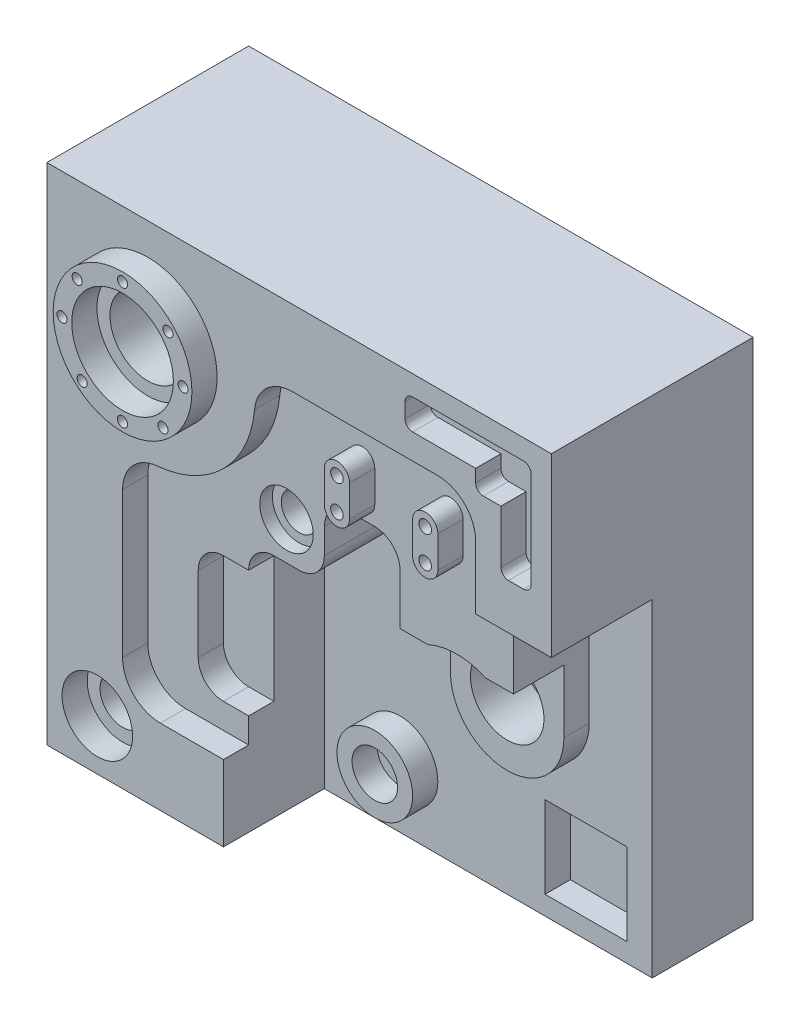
from build123d import *

# Parameters (mm, degrees)
SKETCH1_W                = 200
SKETCH1_H                = 200
BASE_EXTRUDE_DEPTH       = 80
CUT_EXTRUDE1_DEPTH       = 10
SKETCH3_R                = 27.5
BOSS_EXTRUDE4_DEPTH      = 20
CUT_EXTRUDE3_DEPTH       = 30
CUT_EXTRUDE3_DEPTH_BACK  = 30
SKETCH5_W                = 30
SKETCH5_H                = 60
CUT_EXTRUDE6_DEPTH       = 10
SKETCH6_R                = 22.5
CUT_EXTRUDE9_DEPTH       = 40
BOSS_EXTRUDE8_START      = -40
BOSS_EXTRUDE8_DEPTH      = 40
CUT_EXTRUDE10_START      = -30
CUT_EXTRUDE10_DEPTH      = 30
SKETCH9_R                = 27.5
CUT_EXTRUDE14_DEPTH      = 30
CUT_EXTRUDE17_DEPTH      = 10
SKETCH13_R               = 10.606601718
CUT_EXTRUDE20_DEPTH      = 5
SKETCH14_R               = 7.071067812
CUT_EXTRUDE21_DEPTH      = 30
SKETCH16_R               = 14.577379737
CUT_EXTRUDE23_DEPTH      = 20
SKETCH17_R               = 20.155644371
CUT_EXTRUDE24_DEPTH      = 10
SKETCH18_R               = 15
CUT_EXTRUDE25_DEPTH      = 60
SKETCH19_R               = 15
BOSS_EXTRUDE9_DEPTH      = 10
SKETCH20_R               = 9.013878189
CUT_EXTRUDE26_DEPTH      = 10
SKETCH21_R               = 5
CUT_EXTRUDE27_DEPTH      = 30
SKETCH23_W               = 32.5
SKETCH23_H               = 32.5
CUT_EXTRUDE29_DEPTH      = 10
BOSS_EXTRUDE11_DEPTH     = 10
SKETCH26_R               = 2.5
CUT_EXTRUDE30_DEPTH      = 30
CUT_EXTRUDE34_DEPTH      = 10
CUT_EXTRUDE34_DEPTH_BACK = 10
SKETCH27_R               = 2
SKETCH28_R               = 14
CUT_EXTRUDE35_DEPTH      = 10
SKETCH29_R               = 8.94427191
CUT_EXTRUDE36_DEPTH      = 10
SKETCH30_W               = 22
SKETCH30_H               = 20
CUT_EXTRUDE37_DEPTH      = 10
SKETCH31_W               = 12
SKETCH31_H               = 28
CUT_EXTRUDE38_DEPTH      = 10
SKETCH32_W               = 38
SKETCH32_H               = 12
CUT_EXTRUDE39_DEPTH      = 10
FILLET1_R                = 3


with BuildPart() as part:
    # Sketch1 → Base-Extrude (new body)
    with BuildSketch(Plane.XY):
        Rectangle(SKETCH1_W, SKETCH1_H)
    extrude(amount=-BASE_EXTRUDE_DEPTH)

    # Sketch2 → Cut-Extrude1 (cut)
    with BuildSketch(Plane.XY):
        with BuildLine():
            Line((-55, -70), (70, -70))
            Line((70, -70), (70, 55))
            ThreePointArc((70, 55), (65.606601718, 65.606601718), (55, 70))
            Line((55, 70), (-2.717803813, 70))
            ThreePointArc((-2.717803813, 70), (-12.852762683, 66.058146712), (-17.660985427, 56.304347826))
            ThreePointArc((-17.660985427, 56.304347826), (-29.9479618, 29.9479618), (-56.304347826, 17.660985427))
            ThreePointArc((-56.304347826, 17.660985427), (-66.058146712, 12.852762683), (-70, 2.717803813))
            Line((-70, 2.717803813), (-70, -55))
            ThreePointArc((-70, -55), (-65.606601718, -65.606601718), (-55, -70))
        make_face()
    extrude(amount=-CUT_EXTRUDE1_DEPTH, mode=Mode.SUBTRACT)

    # Sketch3 → Boss-Extrude4 (add)
    with BuildSketch(Plane.XY.offset(-10)):
        with Locations(Location((-60, 60, 0), (0, 0, 180))):
            Circle(SKETCH3_R)
    extrude(amount=BOSS_EXTRUDE4_DEPTH)

    # Sketch4 → Cut-Extrude3 (cut, two sides: drawn at the far end of the back side and taken through both)
    with BuildSketch(Plane.XY.offset(-10).offset(-CUT_EXTRUDE3_DEPTH_BACK)):
        with BuildLine():
            Line((-30, -100), (-30, -10))
            ThreePointArc((-30, -10), (-27.071067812, -2.928932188), (-20, 0))
            Line((-20, 0), (-10, 0))
            ThreePointArc((-10, 0), (-2.928932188, 2.928932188), (0, 10))
            Line((0, 10), (0, 20))
            ThreePointArc((0, 20), (2.928932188, 27.071067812), (10, 30))
            Line((10, 30), (20, 30))
            ThreePointArc((20, 30), (27.071067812, 27.071067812), (30, 20))
            Line((30, 20), (30, -10))
            Line((30, -10), (75, -10))
            Line((75, -10), (75, 20))
            ThreePointArc((75, 20), (77.928932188, 27.071067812), (85, 30))
            Line((85, 30), (100, 30))
            Line((100, 30), (100, -100))
            Line((100, -100), (-30, -100))
        make_face()
    extrude(amount=CUT_EXTRUDE3_DEPTH + CUT_EXTRUDE3_DEPTH_BACK, mode=Mode.SUBTRACT)

    # Sketch5 → Cut-Extrude6 (cut)
    with BuildSketch(Plane.XY):
        with Locations((85, 0)):
            Rectangle(SKETCH5_W, SKETCH5_H)
    extrude(amount=-CUT_EXTRUDE6_DEPTH, mode=Mode.SUBTRACT)

    # Sketch6 → Cut-Extrude9 (cut)
    with BuildSketch(Plane.XY.offset(-40)):
        with Locations((52.5, -25)):
            Circle(SKETCH6_R)
    extrude(amount=CUT_EXTRUDE9_DEPTH, mode=Mode.SUBTRACT)

    # Sketch7 → Boss-Extrude8 (add)
    with BuildSketch(Plane.XY.offset(BOSS_EXTRUDE8_START)):
        with BuildLine():
            Line((75, -25), (75, 0))
            Line((75, 0), (30, 0))
            Line((30, 0), (30, -25))
            ThreePointArc((30, -25), (52.5, -47.5), (75, -25))
        make_face()
    extrude(amount=BOSS_EXTRUDE8_DEPTH)

    # Sketch8 → Cut-Extrude10 (cut)
    with BuildSketch(Plane.XY.offset(CUT_EXTRUDE10_START)):
        with BuildLine():
            Line((75, -25), (75, 0))
            Line((75, 0), (30, 0))
            Line((30, 0), (30, -25))
            ThreePointArc((30, -25), (52.5, -47.5), (75, -25))
        make_face()
    extrude(amount=CUT_EXTRUDE10_DEPTH, mode=Mode.SUBTRACT)

    # Sketch9 → Cut-Extrude14 (cut)
    with BuildSketch(Plane.XY):
        with Locations((52.5, -25)):
            Circle(SKETCH9_R)
    extrude(amount=-CUT_EXTRUDE14_DEPTH, mode=Mode.SUBTRACT)

    # Sketch11 → Cut-Extrude17 (cut)
    with BuildSketch(Plane.XY.offset(-10)):
        with BuildLine():
            Line((-40, -10), (-30, -10))
            Line((-30, -10), (-30, -60))
            Line((-30, -60), (-40, -60))
            ThreePointArc((-40, -60), (-47.071067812, -57.071067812), (-50, -50))
            Line((-50, -50), (-50, -20))
            ThreePointArc((-50, -20), (-47.071067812, -12.928932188), (-40, -10))
        make_face()
    extrude(amount=-CUT_EXTRUDE17_DEPTH, mode=Mode.SUBTRACT)

    # Sketch13 → Cut-Extrude20 (cut)
    with BuildSketch(Plane.XY.offset(-10)):
        with Locations((-15, 15)):
            Circle(SKETCH13_R)
    extrude(amount=-CUT_EXTRUDE20_DEPTH, mode=Mode.SUBTRACT)

    # Sketch14 → Cut-Extrude21 (cut)
    with BuildSketch(Plane.XY.offset(-15)):
        with Locations((-15, 15)):
            Circle(SKETCH14_R)
    extrude(amount=-CUT_EXTRUDE21_DEPTH, mode=Mode.SUBTRACT)

    # Sketch16 → Cut-Extrude23 (cut)
    with BuildSketch(Plane.XY.offset(-30)):
        with Locations((52.5, -22.5)):
            Circle(SKETCH16_R)
    extrude(amount=-CUT_EXTRUDE23_DEPTH, mode=Mode.SUBTRACT)

    # Sketch17 → Cut-Extrude24 (cut)
    with BuildSketch(Plane.XY.offset(10)):
        with Locations((-60, 60)):
            Circle(SKETCH17_R)
    extrude(amount=-CUT_EXTRUDE24_DEPTH, mode=Mode.SUBTRACT)

    # Sketch18 → Cut-Extrude25 (cut)
    with BuildSketch(Plane.XY):
        with Locations((-60, 60)):
            Circle(SKETCH18_R)
    extrude(amount=-CUT_EXTRUDE25_DEPTH, mode=Mode.SUBTRACT)

    # Sketch19 → Boss-Extrude9 (add)
    with BuildSketch(Plane.XY.offset(-40)):
        with Locations((0, -75)):
            Circle(SKETCH19_R)
    extrude(amount=BOSS_EXTRUDE9_DEPTH)

    # Sketch20 → Cut-Extrude26 (cut)
    with BuildSketch(Plane.XY.offset(-30)):
        with Locations((0, -75)):
            Circle(SKETCH20_R)
    extrude(amount=-CUT_EXTRUDE26_DEPTH, mode=Mode.SUBTRACT)

    # Sketch21 → Cut-Extrude27 (cut)
    with BuildSketch(Plane.XY.offset(-40)):
        with Locations((0, -75)):
            Circle(SKETCH21_R)
    extrude(amount=-CUT_EXTRUDE27_DEPTH, mode=Mode.SUBTRACT)

    # Sketch23 → Cut-Extrude29 (cut)
    with BuildSketch(Plane.XY.offset(-40)):
        with Locations((73.75, -76.25)):
            Rectangle(SKETCH23_W, SKETCH23_H)
    extrude(amount=-CUT_EXTRUDE29_DEPTH, mode=Mode.SUBTRACT)

    # Sketch25 → Boss-Extrude11 (add)
    with BuildSketch(Plane.XY.offset(-10)):
        with BuildLine():
            Line((20, 50), (20, 37.5))
            ThreePointArc((20, 37.5), (15, 32.5), (10, 37.5))
            Line((10, 37.5), (10, 50))
            ThreePointArc((10, 50), (15, 55), (20, 50))
        make_face()
        with BuildLine():
            Line((55, 50), (55, 37.5))
            ThreePointArc((55, 37.5), (50, 32.5), (45, 37.5))
            Line((45, 37.5), (45, 50))
            ThreePointArc((45, 50), (50, 55), (55, 50))
        make_face()
    extrude(amount=BOSS_EXTRUDE11_DEPTH)

    # Sketch26 → Cut-Extrude30 (cut)
    with BuildSketch(Plane.XY):
        with Locations((15, 50)):
            Circle(SKETCH26_R)
        with Locations((15, 37.5)):
            Circle(SKETCH26_R)
        with Locations((50, 50)):
            Circle(SKETCH26_R)
        with Locations((50, 37.5)):
            Circle(SKETCH26_R)
    extrude(amount=-CUT_EXTRUDE30_DEPTH, mode=Mode.SUBTRACT)

    # Sketch27 → Cut-Extrude34 (cut, two sides: drawn at the far end of the back side and taken through both)
    with BuildSketch(Plane.XY.offset(-CUT_EXTRUDE34_DEPTH_BACK)):
        with Locations((-36, 60)):
            Circle(SKETCH27_R)
        with Locations((-84, 60)):
            Circle(SKETCH27_R)
        with Locations((-60, 84)):
            Circle(SKETCH27_R)
        with Locations((-60, 36)):
            Circle(SKETCH27_R)
        with Locations((-42, 76)):
            Circle(SKETCH27_R)
        with Locations((-78, 76)):
            Circle(SKETCH27_R)
        with Locations((-44, 42)):
            Circle(SKETCH27_R)
        with Locations((-76, 42)):
            Circle(SKETCH27_R)
    extrude(amount=CUT_EXTRUDE34_DEPTH + CUT_EXTRUDE34_DEPTH_BACK, mode=Mode.SUBTRACT)

    # Sketch28 → Cut-Extrude35 (cut)
    with BuildSketch(Plane.XY):
        with Locations((-80, -80)):
            Circle(SKETCH28_R)
    extrude(amount=-CUT_EXTRUDE35_DEPTH, mode=Mode.SUBTRACT)

    # Sketch29 → Cut-Extrude36 (cut)
    with BuildSketch(Plane.XY.offset(-10)):
        with Locations((-80, -80)):
            Circle(SKETCH29_R)
    extrude(amount=-CUT_EXTRUDE36_DEPTH, mode=Mode.SUBTRACT)

    # Sketch30 → Cut-Extrude37 (cut)
    with BuildSketch(Plane.XY):
        with Locations((81, 82)):
            Rectangle(SKETCH30_W, SKETCH30_H)
    extrude(amount=-CUT_EXTRUDE37_DEPTH, mode=Mode.SUBTRACT)

    # Sketch31 → Cut-Extrude38 (cut)
    with BuildSketch(Plane.XY):
        with Locations((86, 62)):
            Rectangle(SKETCH31_W, SKETCH31_H)
    extrude(amount=-CUT_EXTRUDE38_DEPTH, mode=Mode.SUBTRACT)

    # Sketch32 → Cut-Extrude39 (cut)
    with BuildSketch(Plane.XY):
        with Locations((61, 86)):
            Rectangle(SKETCH32_W, SKETCH32_H)
    extrude(amount=-CUT_EXTRUDE39_DEPTH, mode=Mode.SUBTRACT)

    # Fillet1
    fillet1_edges = [part.edges().sort_by_distance(p)[0] for p in [
        (70, 72, -5),
        (92, 92, -5),
        (80, 48, -5),
        (92, 48, -5),
        (42, 92, -5),
        (42, 80, -5),
    ]]
    fillet(fillet1_edges, radius=FILLET1_R)


solid = part.part
